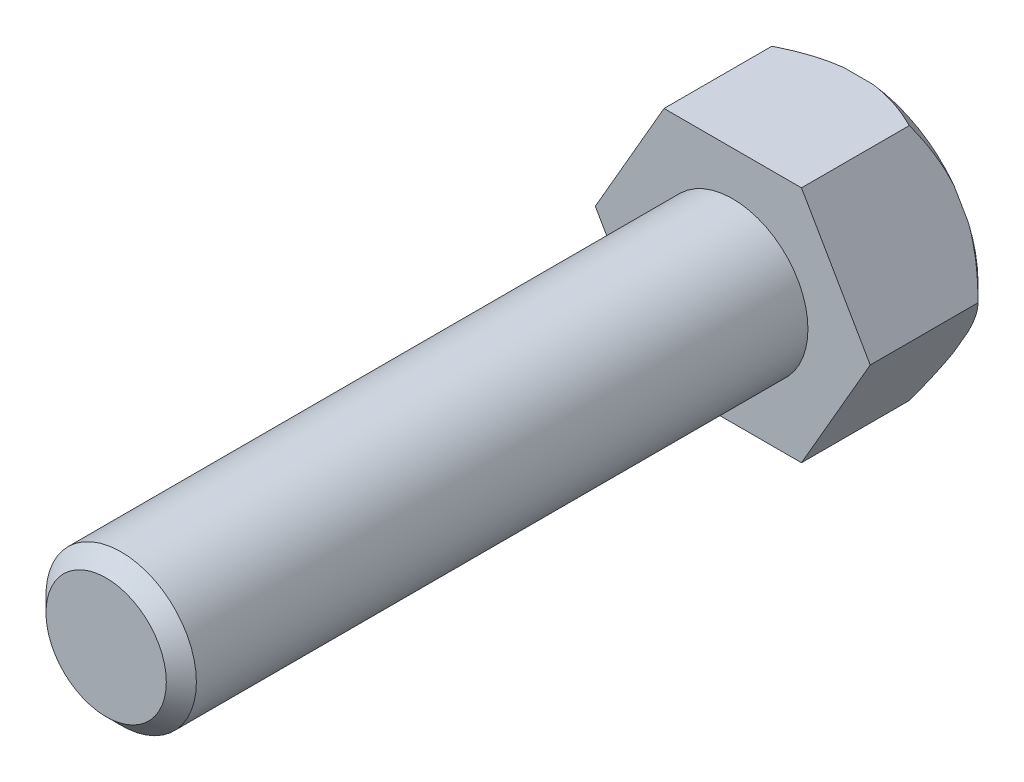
from build123d import *

# Parameters (mm, degrees)
BOSS_EXTRU_1_DEPTH = 10
ESQUISSE2_R        = 6
BOSS_EXTRU_2_DEPTH = 50
CHANFREIN1_SIZE    = 1.2


with BuildPart() as part:
    # Esquisse1 → Boss.-Extru.1 (new body)
    with BuildSketch(Plane.XY):
        Polygon((10.969655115, 0), (5.484827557, 9.5), (-5.484827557, 9.5), (-10.969655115, 0), (-5.484827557, -9.5), (5.484827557, -9.5), align=None)
    extrude(amount=BOSS_EXTRU_1_DEPTH)

    # Esquisse2 → Boss.-Extru.2 (add)
    with BuildSketch(Plane.XY.offset(10)):
        Circle(ESQUISSE2_R)
    extrude(amount=BOSS_EXTRU_2_DEPTH)

    # Chanfrein1
    chanfrein1_edges = [part.edges().sort_by_distance(p)[0] for p in [
        (-6, 0, 60),
    ]]
    chamfer(chanfrein1_edges, length=CHANFREIN1_SIZE)

    # Esquisse3 → Enl_vement de mati_re-R_volution1 (revolve, cut)
    with BuildSketch(Plane(origin=(0, 0, 0), x_dir=(1, 0, 0), z_dir=(0, 1, 0))):
        Polygon((10.969655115, 0), (9.569655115, 0), (10.969655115, -1.4), align=None)
    revolve(axis=Axis((0, 0, 0), (0, 0, 1)), mode=Mode.SUBTRACT)


solid = part.part
